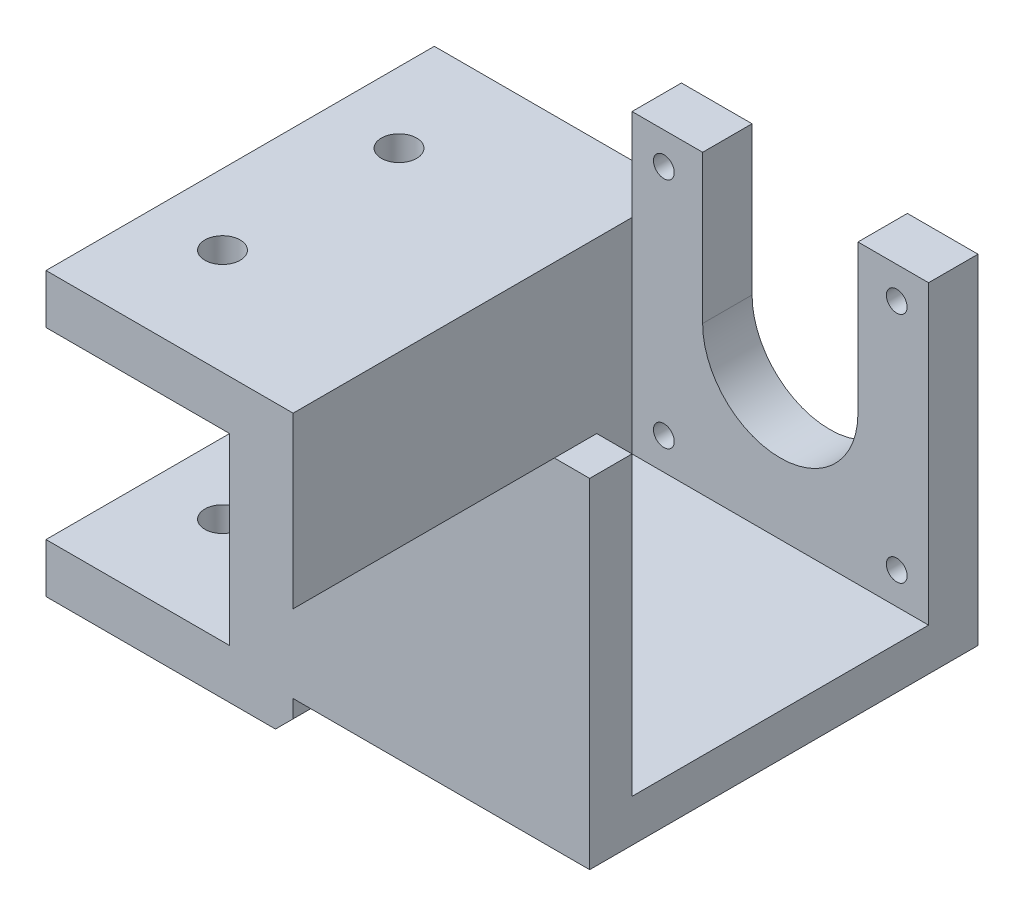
from build123d import *

# Parameters (mm, degrees)
SKETCH1_R           = 1.47
BOSS_EXTRUDE2_DEPTH = 55
SKETCH2_W           = 42
SKETCH2_H           = 42
CUT_EXTRUDE1_DEPTH  = 42
SKETCH4_W           = 6
SKETCH4_H           = 42
CUT_EXTRUDE2_DEPTH  = 42
BOSS_EXTRUDE3_DEPTH = 6
BOSS_EXTRUDE4_DEPTH = 55
SKETCH8_R           = 2.5
CUT_EXTRUDE3_DEPTH  = 55
CUT_EXTRUDE4_DEPTH  = 55


with BuildPart() as part:
    # Sketch1 → Boss-Extrude2 (new body)
    with BuildSketch(Plane.XY):
        with BuildLine():
            Line((-11, 0), (-11, 21))
            Line((-11, 21), (-21, 21))
            Line((-21, 21), (-21, -21))
            Line((-21, -21), (-21, -27))
            Line((-21, -27), (21, -27))
            Line((21, -27), (21, -21))
            Line((21, -21), (21, 21))
            Line((21, 21), (11, 21))
            Line((11, 21), (11, 0))
            ThreePointArc((11, 0), (0, -11), (-11, 0))
        make_face()
        with Locations((-16.49, 16.49)):
            Circle(SKETCH1_R, mode=Mode.SUBTRACT)
        with Locations(Location((16.49, -16.49, 0), (0, 0, 180))):
            Circle(SKETCH1_R, mode=Mode.SUBTRACT)
        with Locations((16.49, 16.49)):
            Circle(SKETCH1_R, mode=Mode.SUBTRACT)
        with Locations(Location((-16.49, -16.49, 0), (0, 0, 180))):
            Circle(SKETCH1_R, mode=Mode.SUBTRACT)
    extrude(amount=BOSS_EXTRUDE2_DEPTH)

    # Sketch2 → Cut-Extrude1 (cut)
    with BuildSketch(Plane(origin=(0, 21, 0), x_dir=(1, 0, 0), z_dir=(0, 1, 0))):
        with Locations((0, -28)):
            Rectangle(SKETCH2_W, SKETCH2_H)
    extrude(amount=-CUT_EXTRUDE1_DEPTH, mode=Mode.SUBTRACT)

    # Sketch4 → Cut-Extrude2 (cut)
    with BuildSketch(Plane.ZY.offset(21)):
        with Locations((52, 0)):
            Rectangle(SKETCH4_W, SKETCH4_H)
    extrude(amount=-CUT_EXTRUDE2_DEPTH, mode=Mode.SUBTRACT)

    # Sketch5 → Boss-Extrude3 (add)
    with BuildSketch(Plane.XY.offset(55)):
        Polygon((-21, -21), (21, -21), (21, 21), (16, 21), (-21, -16), align=None)
    extrude(amount=-BOSS_EXTRUDE3_DEPTH)

    # Sketch7 → Boss-Extrude4 (add)
    with BuildSketch(Plane(origin=(0, 0, 0), x_dir=(-1, 0, 0), z_dir=(0, 0, -1))):
        Polygon((56, 8), (21, 8), (21, -27), (21, -32), (56, -32), (56, -25), (30, -25), (30, 1), (56, 1), align=None)
    extrude(amount=-BOSS_EXTRUDE4_DEPTH)

    # Sketch8 → Cut-Extrude3 (cut)
    with BuildSketch(Plane.XZ.offset(32)):
        with Locations(Location((-46, 40, 0), (0, 0, 270))):
            Circle(SKETCH8_R)
        with Locations(Location((-46, 15, 0), (0, 0, 270))):
            Circle(SKETCH8_R)
    extrude(amount=-CUT_EXTRUDE3_DEPTH, mode=Mode.SUBTRACT)

    # Sketch9 → Cut-Extrude4 (cut)
    with BuildSketch(Plane(origin=(0, 0, 0), x_dir=(-1, 0, 0), z_dir=(0, 0, -1))):
        Polygon((23.5, -32), (21, -32), (21, -29.5), align=None)
    extrude(amount=-CUT_EXTRUDE4_DEPTH, mode=Mode.SUBTRACT)


solid = part.part
